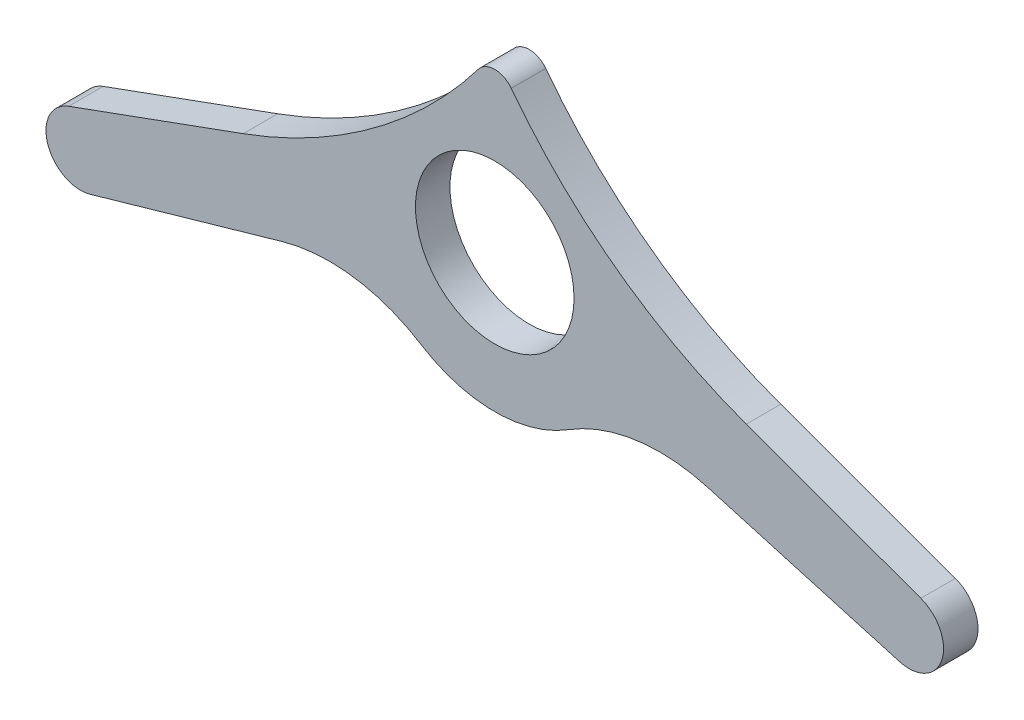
from build123d import *

# Parameters (mm, degrees)
SKETCH1_R           = 11.5
BOSS_EXTRUDE1_DEPTH = 5


with BuildPart() as part:
    # Sketch1 → Boss-Extrude1 (new body)
    with BuildSketch(Plane.XY):
        with BuildLine():
            Line((30.863510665, -14.051466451), (58.700669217, -22.033643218))
            ThreePointArc((58.700669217, -22.033643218), (64.834138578, -18.77241971), (61.788956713, -12.528871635))
            Line((61.788956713, -12.528871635), (36.475889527, -3.315668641))
            ThreePointArc((36.475889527, -3.315668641), (17.622221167, 6.793330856), (2.389515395, 21.813895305))
            ThreePointArc((2.389515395, 21.813895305), (0, 23), (-2.389515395, 21.813895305))
            ThreePointArc((-2.389515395, 21.813895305), (-17.622221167, 6.793330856), (-36.475889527, -3.315668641))
            Line((-36.475889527, -3.315668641), (-61.788956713, -12.528871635))
            ThreePointArc((-61.788956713, -12.528871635), (-64.834138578, -18.77241971), (-58.700669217, -22.033643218))
            Line((-58.700669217, -22.033643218), (-30.863510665, -14.051466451))
            ThreePointArc((-30.863510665, -14.051466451), (-20.452273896, -13.332100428), (-10.654478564, -16.925781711))
            ThreePointArc((-10.654478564, -16.925781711), (0, -20), (10.654478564, -16.925781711))
            ThreePointArc((10.654478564, -16.925781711), (20.452273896, -13.332100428), (30.863510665, -14.051466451))
        make_face()
        Circle(SKETCH1_R, mode=Mode.SUBTRACT)
    extrude(amount=BOSS_EXTRUDE1_DEPTH)


solid = part.part
